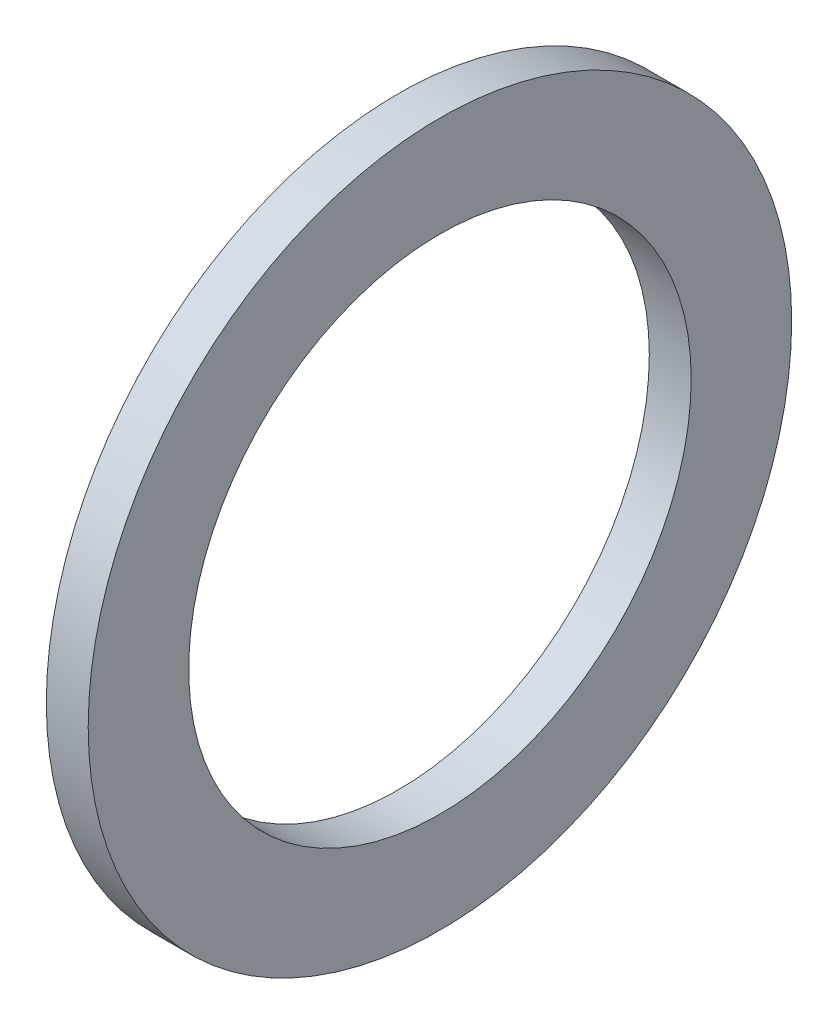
ISO-10303-21;
HEADER;
FILE_DESCRIPTION(('STEP AP214'),'2;1');
FILE_NAME('part.step','',(''),(''),'','','');
FILE_SCHEMA(('AUTOMOTIVE_DESIGN { 1 0 10303 214 1 1 1 1 }'));
ENDSEC;
DATA;
#1=APPLICATION_CONTEXT('core data for automotive mechanical design processes');
#2=APPLICATION_PROTOCOL_DEFINITION('international standard','automotive_design',2000,#1);
#3=PRODUCT_CONTEXT('',#1,'mechanical');
#4=PRODUCT('Part','Part','',(#3));
#5=PRODUCT_RELATED_PRODUCT_CATEGORY('part','',(#4));
#6=PRODUCT_DEFINITION_FORMATION('','',#4);
#7=PRODUCT_DEFINITION_CONTEXT('part definition',#1,'design');
#8=PRODUCT_DEFINITION('design','',#6,#7);
#9=PRODUCT_DEFINITION_SHAPE('','',#8);
#10=(LENGTH_UNIT() NAMED_UNIT(*) SI_UNIT(.MILLI.,.METRE.));
#11=(NAMED_UNIT(*) PLANE_ANGLE_UNIT() SI_UNIT($,.RADIAN.));
#12=(NAMED_UNIT(*) SI_UNIT($,.STERADIAN.) SOLID_ANGLE_UNIT());
#13=UNCERTAINTY_MEASURE_WITH_UNIT(LENGTH_MEASURE(1.E-05),#10,'distance_accuracy_value','');
#14=(GEOMETRIC_REPRESENTATION_CONTEXT(3) GLOBAL_UNCERTAINTY_ASSIGNED_CONTEXT((#13)) GLOBAL_UNIT_ASSIGNED_CONTEXT((#10,
#11,#12)) REPRESENTATION_CONTEXT('',''));
#15=CARTESIAN_POINT('',(0.,0.,0.));
#16=DIRECTION('',(0.,0.,1.));
#17=DIRECTION('',(1.,0.,0.));
#18=AXIS2_PLACEMENT_3D('',#15,#16,#17);
#19=CARTESIAN_POINT('',(2.5,0.,0.));
#20=DIRECTION('',(1.,0.,0.));
#21=DIRECTION('',(0.,0.,-1.));
#22=AXIS2_PLACEMENT_3D('',#19,#20,#21);
#23=CYLINDRICAL_SURFACE('',#22,21.);
#24=CARTESIAN_POINT('',(0.,0.,0.));
#25=DIRECTION('',(1.,0.,0.));
#26=DIRECTION('',(0.,0.,-1.));
#27=AXIS2_PLACEMENT_3D('',#24,#25,#26);
#28=CIRCLE('',#27,21.);
#29=CARTESIAN_POINT('',(0.,0.,-21.));
#30=VERTEX_POINT('',#29);
#31=EDGE_CURVE('E10',#30,#30,#28,.T.);
#32=ORIENTED_EDGE('',*,*,#31,.T.);
#33=EDGE_LOOP('',(#32));
#34=FACE_BOUND('',#33,.T.);
#35=CARTESIAN_POINT('',(2.5,0.,0.));
#36=DIRECTION('',(1.,0.,0.));
#37=DIRECTION('',(0.,0.,-1.));
#38=AXIS2_PLACEMENT_3D('',#35,#36,#37);
#39=CIRCLE('',#38,21.);
#40=CARTESIAN_POINT('',(2.5,0.,-21.));
#41=VERTEX_POINT('',#40);
#42=EDGE_CURVE('E43',#41,#41,#39,.T.);
#43=ORIENTED_EDGE('',*,*,#42,.F.);
#44=EDGE_LOOP('',(#43));
#45=FACE_BOUND('',#44,.T.);
#46=ADVANCED_FACE('F29',(#34,#45),#23,.T.);
#47=CARTESIAN_POINT('',(0.,21.,0.));
#48=DIRECTION('',(-1.,0.,0.));
#49=DIRECTION('',(0.,0.,1.));
#50=AXIS2_PLACEMENT_3D('',#47,#48,#49);
#51=PLANE('',#50);
#52=CARTESIAN_POINT('',(0.,0.,0.));
#53=DIRECTION('',(1.,0.,0.));
#54=DIRECTION('',(0.,0.,-1.));
#55=AXIS2_PLACEMENT_3D('',#52,#53,#54);
#56=CIRCLE('',#55,15.);
#57=CARTESIAN_POINT('',(0.,0.,-15.));
#58=VERTEX_POINT('',#57);
#59=EDGE_CURVE('E35',#58,#58,#56,.T.);
#60=ORIENTED_EDGE('',*,*,#59,.T.);
#61=EDGE_LOOP('',(#60));
#62=FACE_BOUND('',#61,.T.);
#63=ORIENTED_EDGE('',*,*,#31,.F.);
#64=EDGE_LOOP('',(#63));
#65=FACE_BOUND('',#64,.T.);
#66=ADVANCED_FACE('F53',(#62,#65),#51,.T.);
#67=CARTESIAN_POINT('',(2.5,0.,0.));
#68=DIRECTION('',(1.,0.,0.));
#69=DIRECTION('',(0.,0.,-1.));
#70=AXIS2_PLACEMENT_3D('',#67,#68,#69);
#71=CYLINDRICAL_SURFACE('',#70,15.);
#72=CARTESIAN_POINT('',(2.5,0.,0.));
#73=DIRECTION('',(1.,0.,0.));
#74=DIRECTION('',(0.,0.,-1.));
#75=AXIS2_PLACEMENT_3D('',#72,#73,#74);
#76=CIRCLE('',#75,15.);
#77=CARTESIAN_POINT('',(2.5,0.,-15.));
#78=VERTEX_POINT('',#77);
#79=EDGE_CURVE('E39',#78,#78,#76,.T.);
#80=ORIENTED_EDGE('',*,*,#79,.T.);
#81=EDGE_LOOP('',(#80));
#82=FACE_BOUND('',#81,.T.);
#83=ORIENTED_EDGE('',*,*,#59,.F.);
#84=EDGE_LOOP('',(#83));
#85=FACE_BOUND('',#84,.T.);
#86=ADVANCED_FACE('F57',(#82,#85),#71,.F.);
#87=CARTESIAN_POINT('',(2.5,15.,0.));
#88=DIRECTION('',(1.,0.,0.));
#89=DIRECTION('',(0.,0.,-1.));
#90=AXIS2_PLACEMENT_3D('',#87,#88,#89);
#91=PLANE('',#90);
#92=ORIENTED_EDGE('',*,*,#42,.T.);
#93=EDGE_LOOP('',(#92));
#94=FACE_BOUND('',#93,.T.);
#95=ORIENTED_EDGE('',*,*,#79,.F.);
#96=EDGE_LOOP('',(#95));
#97=FACE_BOUND('',#96,.T.);
#98=ADVANCED_FACE('F49',(#94,#97),#91,.T.);
#99=CLOSED_SHELL('',(#46,#66,#86,#98));
#100=MANIFOLD_SOLID_BREP('B2',#99);
#101=ADVANCED_BREP_SHAPE_REPRESENTATION('',(#18,#100),#14);
#102=SHAPE_DEFINITION_REPRESENTATION(#9,#101);
ENDSEC;
END-ISO-10303-21;
